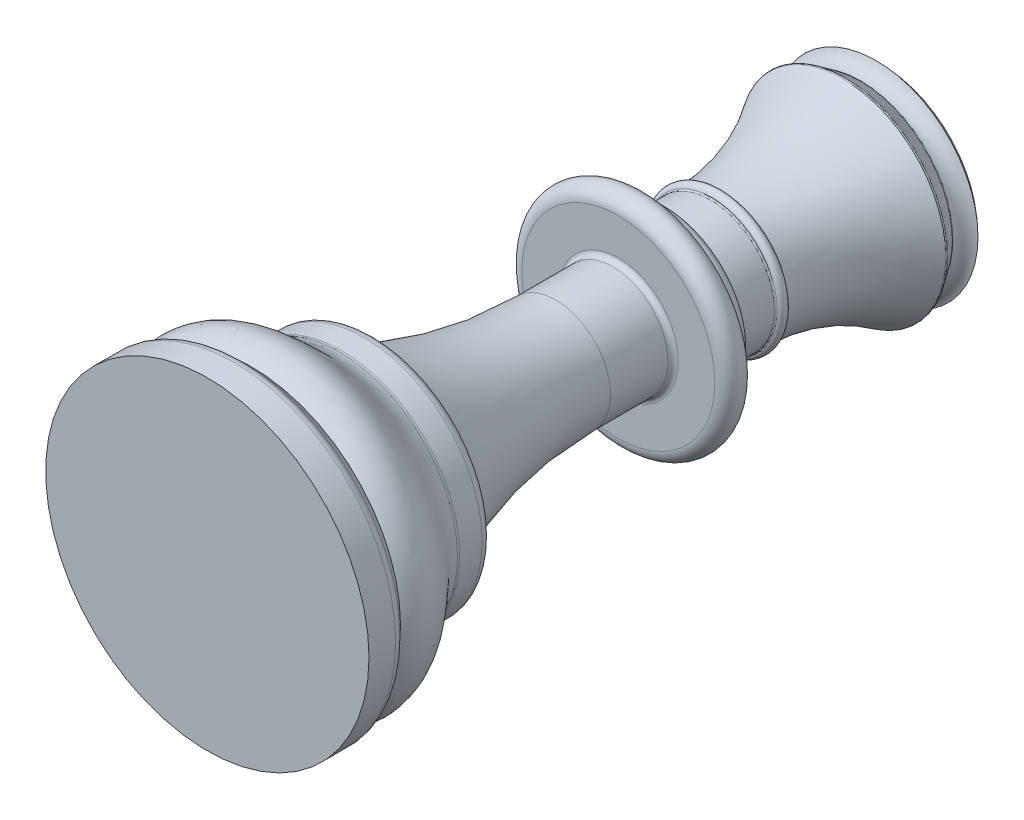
ISO-10303-21;
HEADER;
FILE_DESCRIPTION(('STEP AP214'),'2;1');
FILE_NAME('part.step','',(''),(''),'','','');
FILE_SCHEMA(('AUTOMOTIVE_DESIGN { 1 0 10303 214 1 1 1 1 }'));
ENDSEC;
DATA;
#1=APPLICATION_CONTEXT('core data for automotive mechanical design processes');
#2=APPLICATION_PROTOCOL_DEFINITION('international standard','automotive_design',2000,#1);
#3=PRODUCT_CONTEXT('',#1,'mechanical');
#4=PRODUCT('Part','Part','',(#3));
#5=PRODUCT_RELATED_PRODUCT_CATEGORY('part','',(#4));
#6=PRODUCT_DEFINITION_FORMATION('','',#4);
#7=PRODUCT_DEFINITION_CONTEXT('part definition',#1,'design');
#8=PRODUCT_DEFINITION('design','',#6,#7);
#9=PRODUCT_DEFINITION_SHAPE('','',#8);
#10=(LENGTH_UNIT() NAMED_UNIT(*) SI_UNIT(.MILLI.,.METRE.));
#11=(NAMED_UNIT(*) PLANE_ANGLE_UNIT() SI_UNIT($,.RADIAN.));
#12=(NAMED_UNIT(*) SI_UNIT($,.STERADIAN.) SOLID_ANGLE_UNIT());
#13=UNCERTAINTY_MEASURE_WITH_UNIT(LENGTH_MEASURE(1.E-05),#10,'distance_accuracy_value','');
#14=(GEOMETRIC_REPRESENTATION_CONTEXT(3) GLOBAL_UNCERTAINTY_ASSIGNED_CONTEXT((#13)) GLOBAL_UNIT_ASSIGNED_CONTEXT((#10,
#11,#12)) REPRESENTATION_CONTEXT('',''));
#15=CARTESIAN_POINT('',(0.,0.,0.));
#16=DIRECTION('',(0.,0.,1.));
#17=DIRECTION('',(1.,0.,0.));
#18=AXIS2_PLACEMENT_3D('',#15,#16,#17);
#19=CARTESIAN_POINT('',(0.,0.,0.));
#20=DIRECTION('',(0.,0.,1.));
#21=DIRECTION('',(1.,0.,0.));
#22=AXIS2_PLACEMENT_3D('',#19,#20,#21);
#23=PLANE('',#22);
#24=CARTESIAN_POINT('',(0.,0.,0.));
#25=DIRECTION('',(0.,0.,1.));
#26=DIRECTION('',(1.,0.,0.));
#27=AXIS2_PLACEMENT_3D('',#24,#25,#26);
#28=CIRCLE('',#27,15.5);
#29=CARTESIAN_POINT('',(15.5,0.,0.));
#30=VERTEX_POINT('',#29);
#31=EDGE_CURVE('E136',#30,#30,#28,.T.);
#32=ORIENTED_EDGE('',*,*,#31,.T.);
#33=EDGE_LOOP('',(#32));
#34=FACE_BOUND('',#33,.T.);
#35=ADVANCED_FACE('F35',(#34),#23,.T.);
#36=CARTESIAN_POINT('',(0.,0.,-61.));
#37=DIRECTION('',(0.,0.,1.));
#38=DIRECTION('',(1.,0.,0.));
#39=AXIS2_PLACEMENT_3D('',#36,#37,#38);
#40=CONICAL_SURFACE('',#39,9.94096364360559,0.610330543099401);
#41=CARTESIAN_POINT('',(0.,0.,-61.0857677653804));
#42=DIRECTION('',(0.,0.,-1.));
#43=DIRECTION('',(-1.,0.,0.));
#44=AXIS2_PLACEMENT_3D('',#41,#42,#43);
#45=CIRCLE('',#44,9.88097672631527);
#46=CARTESIAN_POINT('',(-9.88097672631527,0.,-61.0857677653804));
#47=VERTEX_POINT('',#46);
#48=EDGE_CURVE('E64',#47,#47,#45,.T.);
#49=ORIENTED_EDGE('',*,*,#48,.T.);
#50=EDGE_LOOP('',(#49));
#51=FACE_BOUND('',#50,.T.);
#52=CARTESIAN_POINT('',(0.,0.,-62.5925908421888));
#53=DIRECTION('',(0.,0.,1.));
#54=DIRECTION('',(1.,0.,0.));
#55=AXIS2_PLACEMENT_3D('',#52,#53,#54);
#56=CIRCLE('',#55,8.82708811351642);
#57=CARTESIAN_POINT('',(8.82708811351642,0.,-62.5925908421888));
#58=VERTEX_POINT('',#57);
#59=EDGE_CURVE('E67',#58,#58,#56,.T.);
#60=ORIENTED_EDGE('',*,*,#59,.T.);
#61=EDGE_LOOP('',(#60));
#62=FACE_BOUND('',#61,.T.);
#63=ADVANCED_FACE('F201',(#51,#62),#40,.T.);
#64=CARTESIAN_POINT('',(0.,0.,-48.959483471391));
#65=DIRECTION('',(0.,0.,1.));
#66=DIRECTION('',(1.,0.,0.));
#67=AXIS2_PLACEMENT_3D('',#64,#65,#66);
#68=TOROIDAL_SURFACE('',#67,27.1463686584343,21.);
#69=CARTESIAN_POINT('',(0.,0.,-49.4855154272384));
#70=DIRECTION('',(0.,0.,1.));
#71=DIRECTION('',(1.,0.,0.));
#72=AXIS2_PLACEMENT_3D('',#69,#70,#71);
#73=CIRCLE('',#72,6.15295801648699);
#74=CARTESIAN_POINT('',(6.15295801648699,0.,-49.4855154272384));
#75=VERTEX_POINT('',#74);
#76=EDGE_CURVE('E70',#75,#75,#73,.F.);
#77=ORIENTED_EDGE('',*,*,#76,.T.);
#78=EDGE_LOOP('',(#77));
#79=FACE_BOUND('',#78,.T.);
#80=CARTESIAN_POINT('',(0.,0.,-60.9144047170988));
#81=DIRECTION('',(0.,0.,1.));
#82=DIRECTION('',(1.,0.,0.));
#83=AXIS2_PLACEMENT_3D('',#80,#81,#82);
#84=CIRCLE('',#83,9.88137928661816);
#85=CARTESIAN_POINT('',(9.88137928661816,0.,-60.9144047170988));
#86=VERTEX_POINT('',#85);
#87=EDGE_CURVE('E73',#86,#86,#84,.T.);
#88=ORIENTED_EDGE('',*,*,#87,.T.);
#89=EDGE_LOOP('',(#88));
#90=FACE_BOUND('',#89,.T.);
#91=ADVANCED_FACE('F197',(#79,#90),#68,.F.);
#92=CARTESIAN_POINT('',(0.,0.,-48.85));
#93=DIRECTION('',(0.,0.,1.));
#94=DIRECTION('',(1.,0.,0.));
#95=AXIS2_PLACEMENT_3D('',#92,#93,#94);
#96=TOROIDAL_SURFACE('',#95,6.15,0.5);
#97=CARTESIAN_POINT('',(0.,0.,-48.3634957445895));
#98=DIRECTION('',(0.,0.,-1.));
#99=DIRECTION('',(-1.,0.,0.));
#100=AXIS2_PLACEMENT_3D('',#97,#98,#99);
#101=CIRCLE('',#100,6.26538461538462);
#102=CARTESIAN_POINT('',(-6.26538461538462,0.,-48.3634957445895));
#103=VERTEX_POINT('',#102);
#104=EDGE_CURVE('E76',#103,#103,#101,.T.);
#105=ORIENTED_EDGE('',*,*,#104,.T.);
#106=EDGE_LOOP('',(#105));
#107=FACE_BOUND('',#106,.T.);
#108=CARTESIAN_POINT('',(0.,0.,-49.3359677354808));
#109=DIRECTION('',(0.,0.,1.));
#110=DIRECTION('',(1.,0.,0.));
#111=AXIS2_PLACEMENT_3D('',#108,#109,#110);
#112=CIRCLE('',#111,6.26762380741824);
#113=CARTESIAN_POINT('',(6.26762380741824,0.,-49.3359677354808));
#114=VERTEX_POINT('',#113);
#115=EDGE_CURVE('E79',#114,#114,#112,.T.);
#116=ORIENTED_EDGE('',*,*,#115,.T.);
#117=EDGE_LOOP('',(#116));
#118=FACE_BOUND('',#117,.T.);
#119=ADVANCED_FACE('F193',(#107,#118),#96,.T.);
#120=CARTESIAN_POINT('',(0.,0.,0.));
#121=DIRECTION('',(0.,0.,1.));
#122=DIRECTION('',(1.,0.,0.));
#123=AXIS2_PLACEMENT_3D('',#120,#121,#122);
#124=CYLINDRICAL_SURFACE('',#123,6.15);
#125=CARTESIAN_POINT('',(0.,0.,-44.25));
#126=DIRECTION('',(0.,0.,-1.));
#127=DIRECTION('',(-1.,0.,0.));
#128=AXIS2_PLACEMENT_3D('',#125,#126,#127);
#129=CIRCLE('',#128,6.15);
#130=CARTESIAN_POINT('',(-6.15,0.,-44.25));
#131=VERTEX_POINT('',#130);
#132=EDGE_CURVE('E82',#131,#131,#129,.T.);
#133=ORIENTED_EDGE('',*,*,#132,.T.);
#134=EDGE_LOOP('',(#133));
#135=FACE_BOUND('',#134,.T.);
#136=CARTESIAN_POINT('',(0.,0.,-48.2175444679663));
#137=DIRECTION('',(0.,0.,1.));
#138=DIRECTION('',(1.,0.,0.));
#139=AXIS2_PLACEMENT_3D('',#136,#137,#138);
#140=CIRCLE('',#139,6.15);
#141=CARTESIAN_POINT('',(6.15,0.,-48.2175444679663));
#142=VERTEX_POINT('',#141);
#143=EDGE_CURVE('E85',#142,#142,#140,.T.);
#144=ORIENTED_EDGE('',*,*,#143,.T.);
#145=EDGE_LOOP('',(#144));
#146=FACE_BOUND('',#145,.T.);
#147=ADVANCED_FACE('F189',(#135,#146),#124,.T.);
#148=CARTESIAN_POINT('',(8.1,0.,-44.1));
#149=DIRECTION('',(0.,0.,-1.));
#150=DIRECTION('',(-1.,0.,0.));
#151=AXIS2_PLACEMENT_3D('',#148,#149,#150);
#152=PLANE('',#151);
#153=CARTESIAN_POINT('',(0.,0.,-44.1));
#154=DIRECTION('',(0.,0.,-1.));
#155=DIRECTION('',(-1.,0.,0.));
#156=AXIS2_PLACEMENT_3D('',#153,#154,#155);
#157=CIRCLE('',#156,6.3);
#158=CARTESIAN_POINT('',(-6.3,0.,-44.1));
#159=VERTEX_POINT('',#158);
#160=EDGE_CURVE('E88',#159,#159,#157,.F.);
#161=ORIENTED_EDGE('',*,*,#160,.T.);
#162=EDGE_LOOP('',(#161));
#163=FACE_BOUND('',#162,.T.);
#164=CARTESIAN_POINT('',(0.,0.,-44.1));
#165=DIRECTION('',(0.,0.,-1.));
#166=DIRECTION('',(-1.,0.,0.));
#167=AXIS2_PLACEMENT_3D('',#164,#165,#166);
#168=CIRCLE('',#167,7.1);
#169=CARTESIAN_POINT('',(-7.1,0.,-44.1));
#170=VERTEX_POINT('',#169);
#171=EDGE_CURVE('E115',#170,#170,#168,.T.);
#172=ORIENTED_EDGE('',*,*,#171,.T.);
#173=EDGE_LOOP('',(#172));
#174=FACE_BOUND('',#173,.T.);
#175=ADVANCED_FACE('F185',(#163,#174),#152,.T.);
#176=CARTESIAN_POINT('',(0.,0.,0.));
#177=DIRECTION('',(0.,0.,1.));
#178=DIRECTION('',(1.,0.,0.));
#179=AXIS2_PLACEMENT_3D('',#176,#177,#178);
#180=CYLINDRICAL_SURFACE('',#179,8.1);
#181=CARTESIAN_POINT('',(0.,0.,-43.1));
#182=DIRECTION('',(0.,0.,-1.));
#183=DIRECTION('',(-1.,0.,0.));
#184=AXIS2_PLACEMENT_3D('',#181,#182,#183);
#185=CIRCLE('',#184,8.1);
#186=CARTESIAN_POINT('',(-8.1,0.,-43.1));
#187=VERTEX_POINT('',#186);
#188=EDGE_CURVE('E118',#187,#187,#185,.F.);
#189=ORIENTED_EDGE('',*,*,#188,.T.);
#190=EDGE_LOOP('',(#189));
#191=FACE_BOUND('',#190,.T.);
#192=CARTESIAN_POINT('',(0.,0.,-42.6));
#193=DIRECTION('',(0.,0.,1.));
#194=DIRECTION('',(1.,0.,0.));
#195=AXIS2_PLACEMENT_3D('',#192,#193,#194);
#196=CIRCLE('',#195,8.1);
#197=CARTESIAN_POINT('',(8.1,0.,-42.6));
#198=VERTEX_POINT('',#197);
#199=EDGE_CURVE('E121',#198,#198,#196,.T.);
#200=ORIENTED_EDGE('',*,*,#199,.F.);
#201=EDGE_LOOP('',(#200));
#202=FACE_BOUND('',#201,.T.);
#203=ADVANCED_FACE('F181',(#191,#202),#180,.T.);
#204=CARTESIAN_POINT('',(0.,0.,-41.9362757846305));
#205=DIRECTION('',(0.,0.,1.));
#206=DIRECTION('',(1.,0.,0.));
#207=AXIS2_PLACEMENT_3D('',#204,#205,#206);
#208=CONICAL_SURFACE('',#207,9.65202261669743,1.16668229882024);
#209=ORIENTED_EDGE('',*,*,#199,.T.);
#210=EDGE_LOOP('',(#209));
#211=FACE_BOUND('',#210,.T.);
#212=CARTESIAN_POINT('',(0.,0.,-41.9362757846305));
#213=DIRECTION('',(0.,0.,1.));
#214=DIRECTION('',(1.,0.,0.));
#215=AXIS2_PLACEMENT_3D('',#212,#213,#214);
#216=CIRCLE('',#215,9.65202261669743);
#217=CARTESIAN_POINT('',(9.65202261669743,0.,-41.9362757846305));
#218=VERTEX_POINT('',#217);
#219=EDGE_CURVE('E124',#218,#218,#216,.T.);
#220=ORIENTED_EDGE('',*,*,#219,.F.);
#221=EDGE_LOOP('',(#220));
#222=FACE_BOUND('',#221,.T.);
#223=ADVANCED_FACE('F177',(#211,#222),#208,.T.);
#224=CARTESIAN_POINT('',(0.,0.,-40.7));
#225=DIRECTION('',(0.,0.,1.));
#226=DIRECTION('',(1.,0.,0.));
#227=AXIS2_PLACEMENT_3D('',#224,#225,#226);
#228=TOROIDAL_SURFACE('',#227,9.25,1.3);
#229=ORIENTED_EDGE('',*,*,#219,.T.);
#230=EDGE_LOOP('',(#229));
#231=FACE_BOUND('',#230,.T.);
#232=CARTESIAN_POINT('',(0.,0.,-39.4));
#233=DIRECTION('',(0.,0.,1.));
#234=DIRECTION('',(1.,0.,0.));
#235=AXIS2_PLACEMENT_3D('',#232,#233,#234);
#236=CIRCLE('',#235,9.25);
#237=CARTESIAN_POINT('',(9.25,0.,-39.4));
#238=VERTEX_POINT('',#237);
#239=EDGE_CURVE('E127',#238,#238,#236,.T.);
#240=ORIENTED_EDGE('',*,*,#239,.F.);
#241=EDGE_LOOP('',(#240));
#242=FACE_BOUND('',#241,.T.);
#243=ADVANCED_FACE('F174',(#231,#242),#228,.T.);
#244=CARTESIAN_POINT('',(5.25,0.,-39.4));
#245=DIRECTION('',(0.,0.,1.));
#246=DIRECTION('',(1.,0.,0.));
#247=AXIS2_PLACEMENT_3D('',#244,#245,#246);
#248=PLANE('',#247);
#249=CARTESIAN_POINT('',(0.,0.,-39.4));
#250=DIRECTION('',(0.,0.,1.));
#251=DIRECTION('',(1.,0.,0.));
#252=AXIS2_PLACEMENT_3D('',#249,#250,#251);
#253=CIRCLE('',#252,5.75);
#254=CARTESIAN_POINT('',(5.75,0.,-39.4));
#255=VERTEX_POINT('',#254);
#256=EDGE_CURVE('E10',#255,#255,#253,.F.);
#257=ORIENTED_EDGE('',*,*,#256,.T.);
#258=EDGE_LOOP('',(#257));
#259=FACE_BOUND('',#258,.T.);
#260=ORIENTED_EDGE('',*,*,#239,.T.);
#261=EDGE_LOOP('',(#260));
#262=FACE_BOUND('',#261,.T.);
#263=ADVANCED_FACE('F171',(#259,#262),#248,.T.);
#264=CARTESIAN_POINT('',(0.,0.,0.));
#265=DIRECTION('',(0.,0.,1.));
#266=DIRECTION('',(1.,0.,0.));
#267=AXIS2_PLACEMENT_3D('',#264,#265,#266);
#268=CYLINDRICAL_SURFACE('',#267,5.25);
#269=CARTESIAN_POINT('',(0.,0.,-38.9));
#270=DIRECTION('',(0.,0.,1.));
#271=DIRECTION('',(1.,0.,0.));
#272=AXIS2_PLACEMENT_3D('',#269,#270,#271);
#273=CIRCLE('',#272,5.25);
#274=CARTESIAN_POINT('',(5.25,0.,-38.9));
#275=VERTEX_POINT('',#274);
#276=EDGE_CURVE('E42',#275,#275,#273,.T.);
#277=ORIENTED_EDGE('',*,*,#276,.T.);
#278=EDGE_LOOP('',(#277));
#279=FACE_BOUND('',#278,.T.);
#280=CARTESIAN_POINT('',(0.,0.,-33.4));
#281=DIRECTION('',(0.,0.,1.));
#282=DIRECTION('',(1.,0.,0.));
#283=AXIS2_PLACEMENT_3D('',#280,#281,#282);
#284=CIRCLE('',#283,5.25);
#285=CARTESIAN_POINT('',(5.25,0.,-33.4));
#286=VERTEX_POINT('',#285);
#287=EDGE_CURVE('E130',#286,#286,#284,.T.);
#288=ORIENTED_EDGE('',*,*,#287,.F.);
#289=EDGE_LOOP('',(#288));
#290=FACE_BOUND('',#289,.T.);
#291=ADVANCED_FACE('F167',(#279,#290),#268,.T.);
#292=CARTESIAN_POINT('',(0.,0.,-33.4));
#293=DIRECTION('',(0.,0.,1.));
#294=DIRECTION('',(1.,0.,0.));
#295=AXIS2_PLACEMENT_3D('',#292,#293,#294);
#296=TOROIDAL_SURFACE('',#295,45.25,40.);
#297=CARTESIAN_POINT('',(0.,0.,-16.5595722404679));
#298=DIRECTION('',(0.,0.,-1.));
#299=DIRECTION('',(-1.,0.,0.));
#300=AXIS2_PLACEMENT_3D('',#297,#298,#299);
#301=CIRCLE('',#300,8.96777304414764);
#302=CARTESIAN_POINT('',(-8.96777304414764,0.,-16.5595722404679));
#303=VERTEX_POINT('',#302);
#304=EDGE_CURVE('E91',#303,#303,#301,.T.);
#305=ORIENTED_EDGE('',*,*,#304,.T.);
#306=EDGE_LOOP('',(#305));
#307=FACE_BOUND('',#306,.T.);
#308=ORIENTED_EDGE('',*,*,#287,.T.);
#309=EDGE_LOOP('',(#308));
#310=FACE_BOUND('',#309,.T.);
#311=ADVANCED_FACE('F163',(#307,#310),#296,.F.);
#312=CARTESIAN_POINT('',(0.,0.,-15.75));
#313=DIRECTION('',(0.,0.,1.));
#314=DIRECTION('',(1.,0.,0.));
#315=AXIS2_PLACEMENT_3D('',#312,#313,#314);
#316=CONICAL_SURFACE('',#315,11.3278637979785,1.25967906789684);
#317=CARTESIAN_POINT('',(0.,0.,-16.4799250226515));
#318=DIRECTION('',(0.,0.,1.));
#319=DIRECTION('',(1.,0.,0.));
#320=AXIS2_PLACEMENT_3D('',#317,#318,#319);
#321=CIRCLE('',#320,9.05791302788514);
#322=CARTESIAN_POINT('',(9.05791302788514,0.,-16.4799250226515));
#323=VERTEX_POINT('',#322);
#324=EDGE_CURVE('E94',#323,#323,#321,.T.);
#325=ORIENTED_EDGE('',*,*,#324,.T.);
#326=EDGE_LOOP('',(#325));
#327=FACE_BOUND('',#326,.T.);
#328=CARTESIAN_POINT('',(0.,0.,-15.9731231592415));
#329=DIRECTION('',(0.,0.,-1.));
#330=DIRECTION('',(-1.,0.,0.));
#331=AXIS2_PLACEMENT_3D('',#328,#329,#330);
#332=CIRCLE('',#331,10.6339862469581);
#333=CARTESIAN_POINT('',(-10.6339862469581,0.,-15.9731231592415));
#334=VERTEX_POINT('',#333);
#335=EDGE_CURVE('E97',#334,#334,#332,.T.);
#336=ORIENTED_EDGE('',*,*,#335,.T.);
#337=EDGE_LOOP('',(#336));
#338=FACE_BOUND('',#337,.T.);
#339=ADVANCED_FACE('F159',(#327,#338),#316,.T.);
#340=CARTESIAN_POINT('',(0.,0.,0.));
#341=DIRECTION('',(0.,0.,1.));
#342=DIRECTION('',(1.,0.,0.));
#343=AXIS2_PLACEMENT_3D('',#340,#341,#342);
#344=CYLINDRICAL_SURFACE('',#343,11.3278637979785);
#345=CARTESIAN_POINT('',(0.,0.,-12.8646653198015));
#346=DIRECTION('',(0.,0.,1.));
#347=DIRECTION('',(1.,0.,0.));
#348=AXIS2_PLACEMENT_3D('',#345,#346,#347);
#349=CIRCLE('',#348,11.3278637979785);
#350=CARTESIAN_POINT('',(11.3278637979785,0.,-12.8646653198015));
#351=VERTEX_POINT('',#350);
#352=EDGE_CURVE('E100',#351,#351,#349,.F.);
#353=ORIENTED_EDGE('',*,*,#352,.T.);
#354=EDGE_LOOP('',(#353));
#355=FACE_BOUND('',#354,.T.);
#356=CARTESIAN_POINT('',(0.,0.,-15.0211310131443));
#357=DIRECTION('',(0.,0.,-1.));
#358=DIRECTION('',(-1.,0.,0.));
#359=AXIS2_PLACEMENT_3D('',#356,#357,#358);
#360=CIRCLE('',#359,11.3278637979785);
#361=CARTESIAN_POINT('',(-11.3278637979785,0.,-15.0211310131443));
#362=VERTEX_POINT('',#361);
#363=EDGE_CURVE('E103',#362,#362,#360,.F.);
#364=ORIENTED_EDGE('',*,*,#363,.T.);
#365=EDGE_LOOP('',(#364));
#366=FACE_BOUND('',#365,.T.);
#367=ADVANCED_FACE('F154',(#355,#366),#344,.T.);
#368=CARTESIAN_POINT('',(14.2940554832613,0.,-4.22369344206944));
#369=CARTESIAN_POINT('',(16.1819943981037,0.,-6.89827357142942));
#370=CARTESIAN_POINT('',(14.2625898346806,0.,-9.73018194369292));
#371=CARTESIAN_POINT('',(11.9026661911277,0.,-10.1077697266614));
#372=CARTESIAN_POINT('',(11.3278637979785,0.,-12.75));
#373=B_SPLINE_CURVE_WITH_KNOTS('',4,(#368,#369,#370,#371,#372),.UNSPECIFIED.,.F.,.F.,(5,5),(0.,
1.),.UNSPECIFIED.);
#374=CARTESIAN_POINT('',(0.,0.,0.));
#375=DIRECTION('',(0.,0.,1.));
#376=AXIS1_PLACEMENT('',#374,#375);
#377=SURFACE_OF_REVOLUTION('',#373,#376);
#378=CARTESIAN_POINT('',(0.,0.,-12.6224137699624));
#379=DIRECTION('',(0.,0.,1.));
#380=DIRECTION('',(1.,0.,0.));
#381=AXIS2_PLACEMENT_3D('',#378,#379,#380);
#382=CIRCLE('',#381,11.3576503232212);
#383=CARTESIAN_POINT('',(11.3576503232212,0.,-12.6224137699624));
#384=VERTEX_POINT('',#383);
#385=EDGE_CURVE('E106',#384,#384,#382,.T.);
#386=ORIENTED_EDGE('',*,*,#385,.T.);
#387=EDGE_LOOP('',(#386));
#388=FACE_BOUND('',#387,.T.);
#389=CARTESIAN_POINT('',(0.,0.,-4.22369344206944));
#390=DIRECTION('',(0.,0.,1.));
#391=DIRECTION('',(1.,0.,0.));
#392=AXIS2_PLACEMENT_3D('',#389,#390,#391);
#393=CIRCLE('',#392,14.2940554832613);
#394=CARTESIAN_POINT('',(14.2940554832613,0.,-4.22369344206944));
#395=VERTEX_POINT('',#394);
#396=EDGE_CURVE('E133',#395,#395,#393,.T.);
#397=ORIENTED_EDGE('',*,*,#396,.F.);
#398=EDGE_LOOP('',(#397));
#399=FACE_BOUND('',#398,.T.);
#400=ADVANCED_FACE('F149',(#388,#399),#377,.F.);
#401=CARTESIAN_POINT('',(0.,0.,-2.95543073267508));
#402=DIRECTION('',(0.,0.,1.));
#403=DIRECTION('',(1.,0.,0.));
#404=AXIS2_PLACEMENT_3D('',#401,#402,#403);
#405=CONICAL_SURFACE('',#404,15.5,0.760216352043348);
#406=CARTESIAN_POINT('',(0.,0.,-3.24497082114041));
#407=DIRECTION('',(0.,0.,-1.));
#408=DIRECTION('',(-1.,0.,0.));
#409=AXIS2_PLACEMENT_3D('',#406,#407,#408);
#410=CIRCLE('',#409,15.2246869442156);
#411=CARTESIAN_POINT('',(-15.2246869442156,0.,-3.24497082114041));
#412=VERTEX_POINT('',#411);
#413=EDGE_CURVE('E109',#412,#412,#410,.T.);
#414=ORIENTED_EDGE('',*,*,#413,.T.);
#415=EDGE_LOOP('',(#414));
#416=FACE_BOUND('',#415,.T.);
#417=ORIENTED_EDGE('',*,*,#396,.T.);
#418=EDGE_LOOP('',(#417));
#419=FACE_BOUND('',#418,.T.);
#420=ADVANCED_FACE('F153',(#416,#419),#405,.T.);
#421=CARTESIAN_POINT('',(0.,0.,0.));
#422=DIRECTION('',(0.,0.,1.));
#423=DIRECTION('',(1.,0.,0.));
#424=AXIS2_PLACEMENT_3D('',#421,#422,#423);
#425=CYLINDRICAL_SURFACE('',#424,15.5);
#426=CARTESIAN_POINT('',(0.,0.,-2.55589257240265));
#427=DIRECTION('',(0.,0.,-1.));
#428=DIRECTION('',(-1.,0.,0.));
#429=AXIS2_PLACEMENT_3D('',#426,#427,#428);
#430=CIRCLE('',#429,15.5);
#431=CARTESIAN_POINT('',(-15.5,0.,-2.55589257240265));
#432=VERTEX_POINT('',#431);
#433=EDGE_CURVE('E112',#432,#432,#430,.F.);
#434=ORIENTED_EDGE('',*,*,#433,.T.);
#435=EDGE_LOOP('',(#434));
#436=FACE_BOUND('',#435,.T.);
#437=ORIENTED_EDGE('',*,*,#31,.F.);
#438=EDGE_LOOP('',(#437));
#439=FACE_BOUND('',#438,.T.);
#440=ADVANCED_FACE('F223',(#436,#439),#425,.T.);
#441=CARTESIAN_POINT('',(0.,0.,-43.1));
#442=DIRECTION('',(0.,0.,-1.));
#443=DIRECTION('',(-1.,0.,0.));
#444=AXIS2_PLACEMENT_3D('',#441,#442,#443);
#445=TOROIDAL_SURFACE('',#444,7.1,1.);
#446=ORIENTED_EDGE('',*,*,#171,.F.);
#447=EDGE_LOOP('',(#446));
#448=FACE_BOUND('',#447,.T.);
#449=ORIENTED_EDGE('',*,*,#188,.F.);
#450=EDGE_LOOP('',(#449));
#451=FACE_BOUND('',#450,.T.);
#452=ADVANCED_FACE('F219',(#448,#451),#445,.T.);
#453=CARTESIAN_POINT('',(0.,0.,-2.55589257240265));
#454=DIRECTION('',(0.,0.,-1.));
#455=DIRECTION('',(-1.,0.,0.));
#456=AXIS2_PLACEMENT_3D('',#453,#454,#455);
#457=TOROIDAL_SURFACE('',#456,14.5,1.);
#458=ORIENTED_EDGE('',*,*,#413,.F.);
#459=EDGE_LOOP('',(#458));
#460=FACE_BOUND('',#459,.T.);
#461=ORIENTED_EDGE('',*,*,#433,.F.);
#462=EDGE_LOOP('',(#461));
#463=FACE_BOUND('',#462,.T.);
#464=ADVANCED_FACE('F222',(#460,#463),#457,.T.);
#465=CARTESIAN_POINT('',(0.,0.,-12.8646653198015));
#466=DIRECTION('',(0.,0.,1.));
#467=DIRECTION('',(1.,0.,0.));
#468=AXIS2_PLACEMENT_3D('',#465,#466,#467);
#469=TOROIDAL_SURFACE('',#468,12.3278637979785,1.);
#470=ORIENTED_EDGE('',*,*,#352,.F.);
#471=EDGE_LOOP('',(#470));
#472=FACE_BOUND('',#471,.T.);
#473=ORIENTED_EDGE('',*,*,#385,.F.);
#474=EDGE_LOOP('',(#473));
#475=FACE_BOUND('',#474,.T.);
#476=ADVANCED_FACE('F227',(#472,#475),#469,.F.);
#477=CARTESIAN_POINT('',(0.,0.,-15.0211310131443));
#478=DIRECTION('',(0.,0.,-1.));
#479=DIRECTION('',(-1.,0.,0.));
#480=AXIS2_PLACEMENT_3D('',#477,#478,#479);
#481=TOROIDAL_SURFACE('',#480,10.3278637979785,1.);
#482=ORIENTED_EDGE('',*,*,#335,.F.);
#483=EDGE_LOOP('',(#482));
#484=FACE_BOUND('',#483,.T.);
#485=ORIENTED_EDGE('',*,*,#363,.F.);
#486=EDGE_LOOP('',(#485));
#487=FACE_BOUND('',#486,.T.);
#488=ADVANCED_FACE('F231',(#484,#487),#481,.T.);
#489=CARTESIAN_POINT('',(0.,0.,-62.7283963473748));
#490=DIRECTION('',(0.,0.,1.));
#491=DIRECTION('',(1.,0.,0.));
#492=AXIS2_PLACEMENT_3D('',#489,#490,#491);
#493=TOROIDAL_SURFACE('',#492,10.2990867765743,1.5);
#494=CARTESIAN_POINT('',(0.,0.,-62.6730244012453));
#495=DIRECTION('',(0.,0.,-1.));
#496=DIRECTION('',(-1.,0.,0.));
#497=AXIS2_PLACEMENT_3D('',#494,#495,#496);
#498=CIRCLE('',#497,8.80010914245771);
#499=CARTESIAN_POINT('',(-8.80010914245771,0.,-62.6730244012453));
#500=VERTEX_POINT('',#499);
#501=EDGE_CURVE('E61',#500,#500,#498,.T.);
#502=ORIENTED_EDGE('',*,*,#501,.T.);
#503=EDGE_LOOP('',(#502));
#504=FACE_BOUND('',#503,.T.);
#505=CARTESIAN_POINT('',(0.,0.,-64.1277978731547));
#506=DIRECTION('',(0.,0.,1.));
#507=DIRECTION('',(1.,0.,0.));
#508=AXIS2_PLACEMENT_3D('',#505,#506,#507);
#509=CIRCLE('',#508,9.75901699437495);
#510=CARTESIAN_POINT('',(9.75901699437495,0.,-64.1277978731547));
#511=VERTEX_POINT('',#510);
#512=EDGE_CURVE('E281',#511,#511,#509,.T.);
#513=ORIENTED_EDGE('',*,*,#512,.T.);
#514=EDGE_LOOP('',(#513));
#515=FACE_BOUND('',#514,.T.);
#516=ADVANCED_FACE('F235',(#504,#515),#493,.F.);
#517=CARTESIAN_POINT('',(0.,0.,-61.1452026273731));
#518=DIRECTION('',(0.,0.,1.));
#519=DIRECTION('',(1.,0.,0.));
#520=AXIS2_PLACEMENT_3D('',#517,#518,#519);
#521=TOROIDAL_SURFACE('',#520,9.54861203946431,3.5);
#522=CARTESIAN_POINT('',(0.,0.,-62.9464112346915));
#523=DIRECTION('',(0.,0.,1.));
#524=DIRECTION('',(1.,0.,0.));
#525=AXIS2_PLACEMENT_3D('',#522,#523,#524);
#526=CIRCLE('',#525,6.547670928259);
#527=CARTESIAN_POINT('',(6.547670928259,0.,-62.9464112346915));
#528=VERTEX_POINT('',#527);
#529=EDGE_CURVE('E46',#528,#528,#526,.T.);
#530=ORIENTED_EDGE('',*,*,#529,.T.);
#531=EDGE_LOOP('',(#530));
#532=FACE_BOUND('',#531,.T.);
#533=CARTESIAN_POINT('',(0.,0.,-64.6277978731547));
#534=DIRECTION('',(0.,0.,1.));
#535=DIRECTION('',(1.,0.,0.));
#536=AXIS2_PLACEMENT_3D('',#533,#534,#535);
#537=CIRCLE('',#536,9.2);
#538=CARTESIAN_POINT('',(9.2,0.,-64.6277978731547));
#539=VERTEX_POINT('',#538);
#540=EDGE_CURVE('E139',#539,#539,#537,.T.);
#541=ORIENTED_EDGE('',*,*,#540,.F.);
#542=EDGE_LOOP('',(#541));
#543=FACE_BOUND('',#542,.T.);
#544=ADVANCED_FACE('F274',(#532,#543),#521,.T.);
#545=CARTESIAN_POINT('',(0.,0.,-64.1277978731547));
#546=DIRECTION('',(0.,0.,1.));
#547=DIRECTION('',(1.,0.,0.));
#548=AXIS2_PLACEMENT_3D('',#545,#546,#547);
#549=CONICAL_SURFACE('',#548,9.75901699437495,0.841068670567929);
#550=ORIENTED_EDGE('',*,*,#540,.T.);
#551=EDGE_LOOP('',(#550));
#552=FACE_BOUND('',#551,.T.);
#553=ORIENTED_EDGE('',*,*,#512,.F.);
#554=EDGE_LOOP('',(#553));
#555=FACE_BOUND('',#554,.T.);
#556=ADVANCED_FACE('F214',(#552,#555),#549,.T.);
#557=CARTESIAN_POINT('',(0.,0.,-63.25));
#558=DIRECTION('',(0.,0.,1.));
#559=DIRECTION('',(1.,0.,0.));
#560=AXIS2_PLACEMENT_3D('',#557,#558,#559);
#561=SPHERICAL_SURFACE('',#560,2.75);
#562=CARTESIAN_POINT('',(0.,0.,-63.3786780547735));
#563=DIRECTION('',(0.,0.,1.));
#564=DIRECTION('',(1.,0.,0.));
#565=AXIS2_PLACEMENT_3D('',#562,#563,#564);
#566=CIRCLE('',#565,2.74698779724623);
#567=CARTESIAN_POINT('',(2.74698779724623,0.,-63.3786780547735));
#568=VERTEX_POINT('',#567);
#569=EDGE_CURVE('E50',#568,#568,#566,.F.);
#570=ORIENTED_EDGE('',*,*,#569,.T.);
#571=EDGE_LOOP('',(#570));
#572=FACE_BOUND('',#571,.T.);
#573=ADVANCED_FACE('F210',(#572),#561,.T.);
#574=CARTESIAN_POINT('',(0.,0.,-62.6277978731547));
#575=DIRECTION('',(0.,0.,1.));
#576=DIRECTION('',(1.,0.,0.));
#577=AXIS2_PLACEMENT_3D('',#574,#575,#576);
#578=CONICAL_SURFACE('',#577,8.80246392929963,1.46835472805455);
#579=CARTESIAN_POINT('',(0.,0.,-63.2364832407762));
#580=DIRECTION('',(0.,0.,1.));
#581=DIRECTION('',(1.,0.,0.));
#582=AXIS2_PLACEMENT_3D('',#579,#580,#581);
#583=CIRCLE('',#582,2.88148411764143);
#584=CARTESIAN_POINT('',(2.88148411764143,0.,-63.2364832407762));
#585=VERTEX_POINT('',#584);
#586=EDGE_CURVE('E55',#585,#585,#583,.T.);
#587=ORIENTED_EDGE('',*,*,#586,.T.);
#588=EDGE_LOOP('',(#587));
#589=FACE_BOUND('',#588,.T.);
#590=CARTESIAN_POINT('',(0.,0.,-62.874392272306));
#591=DIRECTION('',(0.,0.,1.));
#592=DIRECTION('',(1.,0.,0.));
#593=AXIS2_PLACEMENT_3D('',#590,#591,#592);
#594=CIRCLE('',#593,6.40371978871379);
#595=CARTESIAN_POINT('',(6.40371978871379,0.,-62.874392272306));
#596=VERTEX_POINT('',#595);
#597=EDGE_CURVE('E58',#596,#596,#594,.F.);
#598=ORIENTED_EDGE('',*,*,#597,.T.);
#599=EDGE_LOOP('',(#598));
#600=FACE_BOUND('',#599,.T.);
#601=ADVANCED_FACE('F206',(#589,#600),#578,.T.);
#602=CARTESIAN_POINT('',(0.,0.,-16.6227238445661));
#603=DIRECTION('',(0.,0.,1.));
#604=DIRECTION('',(1.,0.,0.));
#605=AXIS2_PLACEMENT_3D('',#602,#603,#604);
#606=TOROIDAL_SURFACE('',#605,9.10383139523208,0.15);
#607=ORIENTED_EDGE('',*,*,#304,.F.);
#608=EDGE_LOOP('',(#607));
#609=FACE_BOUND('',#608,.T.);
#610=ORIENTED_EDGE('',*,*,#324,.F.);
#611=EDGE_LOOP('',(#610));
#612=FACE_BOUND('',#611,.T.);
#613=ADVANCED_FACE('F209',(#609,#612),#606,.F.);
#614=CARTESIAN_POINT('',(0.,0.,-44.25));
#615=DIRECTION('',(0.,0.,-1.));
#616=DIRECTION('',(-1.,0.,0.));
#617=AXIS2_PLACEMENT_3D('',#614,#615,#616);
#618=TOROIDAL_SURFACE('',#617,6.3,0.15);
#619=ORIENTED_EDGE('',*,*,#132,.F.);
#620=EDGE_LOOP('',(#619));
#621=FACE_BOUND('',#620,.T.);
#622=ORIENTED_EDGE('',*,*,#160,.F.);
#623=EDGE_LOOP('',(#622));
#624=FACE_BOUND('',#623,.T.);
#625=ADVANCED_FACE('F239',(#621,#624),#618,.F.);
#626=CARTESIAN_POINT('',(0.,0.,-48.2175444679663));
#627=DIRECTION('',(0.,0.,1.));
#628=DIRECTION('',(1.,0.,0.));
#629=AXIS2_PLACEMENT_3D('',#626,#627,#628);
#630=TOROIDAL_SURFACE('',#629,6.3,0.15);
#631=ORIENTED_EDGE('',*,*,#104,.F.);
#632=EDGE_LOOP('',(#631));
#633=FACE_BOUND('',#632,.T.);
#634=ORIENTED_EDGE('',*,*,#143,.F.);
#635=EDGE_LOOP('',(#634));
#636=FACE_BOUND('',#635,.T.);
#637=ADVANCED_FACE('F243',(#633,#636),#630,.F.);
#638=CARTESIAN_POINT('',(0.,0.,-49.4817580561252));
#639=DIRECTION('',(0.,0.,1.));
#640=DIRECTION('',(1.,0.,0.));
#641=AXIS2_PLACEMENT_3D('',#638,#639,#640);
#642=TOROIDAL_SURFACE('',#641,6.30291094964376,0.15);
#643=ORIENTED_EDGE('',*,*,#76,.F.);
#644=EDGE_LOOP('',(#643));
#645=FACE_BOUND('',#644,.T.);
#646=ORIENTED_EDGE('',*,*,#115,.F.);
#647=EDGE_LOOP('',(#646));
#648=FACE_BOUND('',#647,.T.);
#649=ADVANCED_FACE('F247',(#645,#648),#642,.F.);
#650=CARTESIAN_POINT('',(0.,0.,-60.999797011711));
#651=DIRECTION('',(0.,0.,-1.));
#652=DIRECTION('',(-1.,0.,0.));
#653=AXIS2_PLACEMENT_3D('',#650,#651,#652);
#654=TOROIDAL_SURFACE('',#653,9.75805793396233,0.15);
#655=ORIENTED_EDGE('',*,*,#48,.F.);
#656=EDGE_LOOP('',(#655));
#657=FACE_BOUND('',#656,.T.);
#658=ORIENTED_EDGE('',*,*,#87,.F.);
#659=EDGE_LOOP('',(#658));
#660=FACE_BOUND('',#659,.T.);
#661=ADVANCED_FACE('F251',(#657,#660),#654,.T.);
#662=CARTESIAN_POINT('',(0.,0.,-62.6785615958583));
#663=DIRECTION('',(0.,0.,1.));
#664=DIRECTION('',(1.,0.,0.));
#665=AXIS2_PLACEMENT_3D('',#662,#663,#664);
#666=TOROIDAL_SURFACE('',#665,8.95000690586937,0.15);
#667=ORIENTED_EDGE('',*,*,#501,.F.);
#668=EDGE_LOOP('',(#667));
#669=FACE_BOUND('',#668,.T.);
#670=ORIENTED_EDGE('',*,*,#59,.F.);
#671=EDGE_LOOP('',(#670));
#672=FACE_BOUND('',#671,.T.);
#673=ADVANCED_FACE('F255',(#669,#672),#666,.F.);
#674=CARTESIAN_POINT('',(0.,0.,-63.3856968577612));
#675=DIRECTION('',(0.,0.,-1.));
#676=DIRECTION('',(-1.,0.,0.));
#677=AXIS2_PLACEMENT_3D('',#674,#675,#676);
#678=TOROIDAL_SURFACE('',#677,2.89682349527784,0.15);
#679=ORIENTED_EDGE('',*,*,#569,.F.);
#680=EDGE_LOOP('',(#679));
#681=FACE_BOUND('',#680,.T.);
#682=ORIENTED_EDGE('',*,*,#586,.F.);
#683=EDGE_LOOP('',(#682));
#684=FACE_BOUND('',#683,.T.);
#685=ADVANCED_FACE('F259',(#681,#684),#678,.F.);
#686=CARTESIAN_POINT('',(0.,0.,-63.0236058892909));
#687=DIRECTION('',(0.,0.,1.));
#688=DIRECTION('',(1.,0.,0.));
#689=AXIS2_PLACEMENT_3D('',#686,#687,#688);
#690=TOROIDAL_SURFACE('',#689,6.4190591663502,0.15);
#691=ORIENTED_EDGE('',*,*,#597,.F.);
#692=EDGE_LOOP('',(#691));
#693=FACE_BOUND('',#692,.T.);
#694=ORIENTED_EDGE('',*,*,#529,.F.);
#695=EDGE_LOOP('',(#694));
#696=FACE_BOUND('',#695,.T.);
#697=ADVANCED_FACE('F262',(#693,#696),#690,.F.);
#698=CARTESIAN_POINT('',(0.,0.,-38.9));
#699=DIRECTION('',(0.,0.,1.));
#700=DIRECTION('',(1.,0.,0.));
#701=AXIS2_PLACEMENT_3D('',#698,#699,#700);
#702=TOROIDAL_SURFACE('',#701,5.75,0.5);
#703=ORIENTED_EDGE('',*,*,#256,.F.);
#704=EDGE_LOOP('',(#703));
#705=FACE_BOUND('',#704,.T.);
#706=ORIENTED_EDGE('',*,*,#276,.F.);
#707=EDGE_LOOP('',(#706));
#708=FACE_BOUND('',#707,.T.);
#709=ADVANCED_FACE('F37',(#705,#708),#702,.F.);
#710=CLOSED_SHELL('',(#35,#63,#91,#119,#147,#175,#203,#223,#243,#263,#291,#311,#339,#367,#400,
#420,#440,#452,#464,#476,#488,#516,#544,#556,#573,#601,#613,#625,#637,#649,#661,#673,#685,#697,#709));
#711=MANIFOLD_SOLID_BREP('B2',#710);
#712=ADVANCED_BREP_SHAPE_REPRESENTATION('',(#18,#711),#14);
#713=SHAPE_DEFINITION_REPRESENTATION(#9,#712);
ENDSEC;
END-ISO-10303-21;
